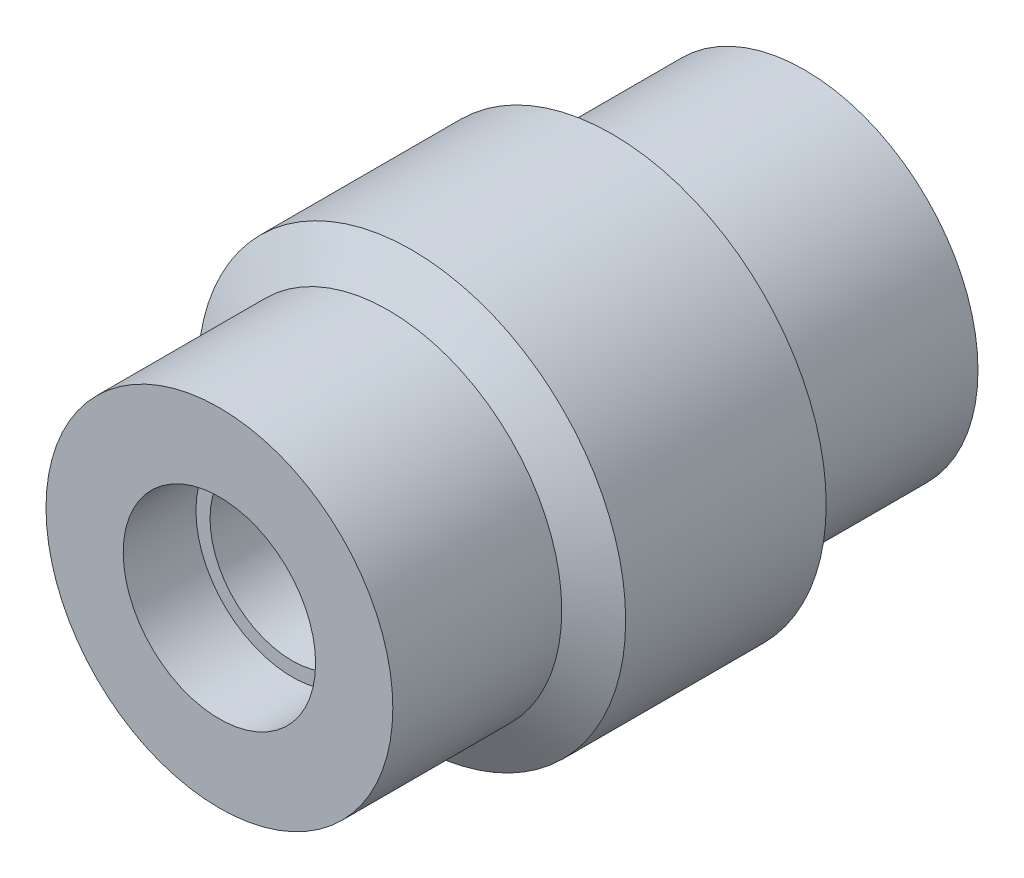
from build123d import *

# Parameters (mm, degrees)
SKETCH1_R           = 7.3914
SKETCH1_R_2         = 3.5
BOSS_EXTRUDE1_DEPTH = 24.9428
SKETCH3_R           = 4.1
CUT_EXTRUDE1_DEPTH  = 3.1


with BuildPart() as part:
    # Sketch1 → Boss-Extrude1 (new body)
    with BuildSketch(Plane.XY):
        Circle(SKETCH1_R)
        Circle(SKETCH1_R_2, mode=Mode.SUBTRACT)
    extrude(amount=BOSS_EXTRUDE1_DEPTH)

    # Sketch2 → Revolve1 (revolve)
    with BuildSketch(Plane(origin=(0, 0, 0), x_dir=(1, 0, 0), z_dir=(0, 1, 0))):
        Polygon((-7.3914, -7.2009), (-7.3914, -17.7419), (-9.1186, -16.744700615), (-9.1186, -8.198099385), align=None)
    revolve(axis=Axis((0, 0, 0), (0, 0, 1)))

    # Sketch3 → Cut-Extrude1 (cut)
    with BuildSketch(Plane.XY.offset(24.9428)):
        Circle(SKETCH3_R)
    cut_extrude1 = extrude(amount=-CUT_EXTRUDE1_DEPTH, mode=Mode.SUBTRACT)

    # Mirror1: Cut-Extrude1 across plane
    add(cut_extrude1.mirror(Plane.XY.offset(12.4714)), mode=Mode.SUBTRACT)


solid = part.part
